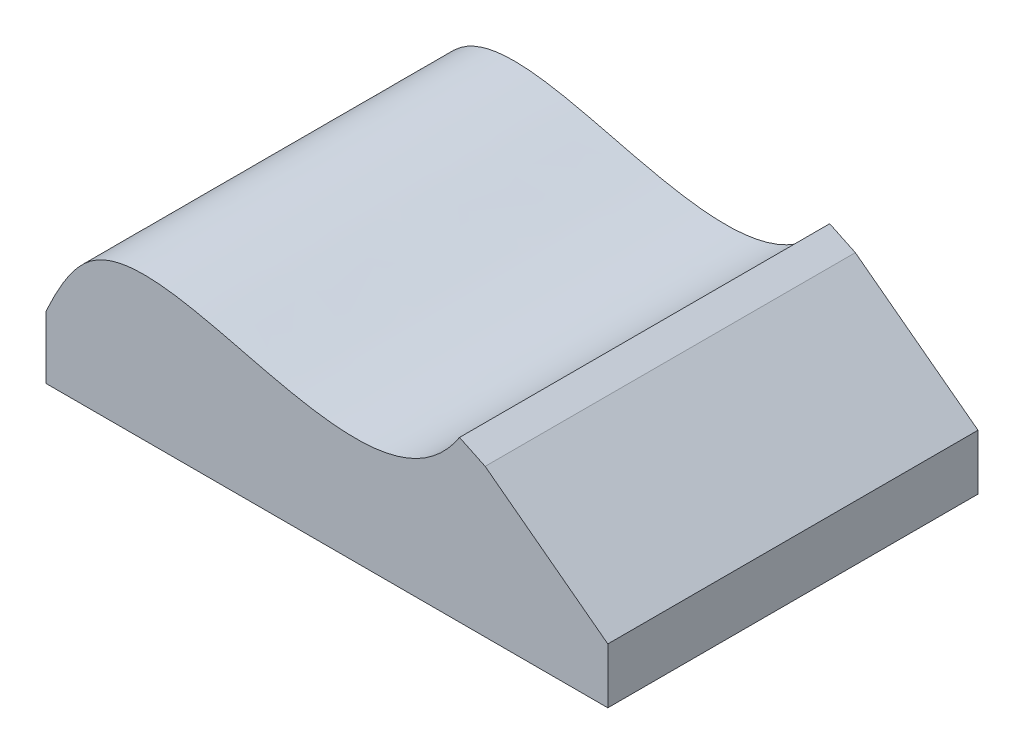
ISO-10303-21;
HEADER;
FILE_DESCRIPTION(('STEP AP214'),'2;1');
FILE_NAME('part.step','',(''),(''),'','','');
FILE_SCHEMA(('AUTOMOTIVE_DESIGN { 1 0 10303 214 1 1 1 1 }'));
ENDSEC;
DATA;
#1=APPLICATION_CONTEXT('core data for automotive mechanical design processes');
#2=APPLICATION_PROTOCOL_DEFINITION('international standard','automotive_design',2000,#1);
#3=PRODUCT_CONTEXT('',#1,'mechanical');
#4=PRODUCT('Part','Part','',(#3));
#5=PRODUCT_RELATED_PRODUCT_CATEGORY('part','',(#4));
#6=PRODUCT_DEFINITION_FORMATION('','',#4);
#7=PRODUCT_DEFINITION_CONTEXT('part definition',#1,'design');
#8=PRODUCT_DEFINITION('design','',#6,#7);
#9=PRODUCT_DEFINITION_SHAPE('','',#8);
#10=(LENGTH_UNIT() NAMED_UNIT(*) SI_UNIT(.MILLI.,.METRE.));
#11=(NAMED_UNIT(*) PLANE_ANGLE_UNIT() SI_UNIT($,.RADIAN.));
#12=(NAMED_UNIT(*) SI_UNIT($,.STERADIAN.) SOLID_ANGLE_UNIT());
#13=UNCERTAINTY_MEASURE_WITH_UNIT(LENGTH_MEASURE(1.E-05),#10,'distance_accuracy_value','');
#14=(GEOMETRIC_REPRESENTATION_CONTEXT(3) GLOBAL_UNCERTAINTY_ASSIGNED_CONTEXT((#13)) GLOBAL_UNIT_ASSIGNED_CONTEXT((#10,
#11,#12)) REPRESENTATION_CONTEXT('',''));
#15=CARTESIAN_POINT('',(0.,0.,0.));
#16=DIRECTION('',(0.,0.,1.));
#17=DIRECTION('',(1.,0.,0.));
#18=AXIS2_PLACEMENT_3D('',#15,#16,#17);
#19=CARTESIAN_POINT('',(0.,0.,0.));
#20=DIRECTION('',(0.,-1.,0.));
#21=DIRECTION('',(0.,0.,-1.));
#22=AXIS2_PLACEMENT_3D('',#19,#20,#21);
#23=PLANE('',#22);
#24=DIRECTION('',(0.,0.,-1.));
#25=VECTOR('',#24,1.);
#26=CARTESIAN_POINT('',(63.7046783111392,0.,41.9735477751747));
#27=LINE('',#26,#25);
#28=CARTESIAN_POINT('',(63.7046783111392,0.,41.9735477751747));
#29=VERTEX_POINT('',#28);
#30=CARTESIAN_POINT('',(63.7046783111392,0.,-41.9735477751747));
#31=VERTEX_POINT('',#30);
#32=EDGE_CURVE('E121',#29,#31,#27,.T.);
#33=ORIENTED_EDGE('',*,*,#32,.F.);
#34=DIRECTION('',(1.,0.,0.));
#35=VECTOR('',#34,1.);
#36=CARTESIAN_POINT('',(-63.7046783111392,0.,41.9735477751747));
#37=LINE('',#36,#35);
#38=CARTESIAN_POINT('',(-63.7046783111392,0.,41.9735477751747));
#39=VERTEX_POINT('',#38);
#40=EDGE_CURVE('E130',#39,#29,#37,.T.);
#41=ORIENTED_EDGE('',*,*,#40,.F.);
#42=DIRECTION('',(0.,0.,1.));
#43=VECTOR('',#42,1.);
#44=CARTESIAN_POINT('',(-63.7046783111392,0.,41.9735477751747));
#45=LINE('',#44,#43);
#46=CARTESIAN_POINT('',(-63.7046783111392,0.,-41.9735477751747));
#47=VERTEX_POINT('',#46);
#48=EDGE_CURVE('E127',#47,#39,#45,.T.);
#49=ORIENTED_EDGE('',*,*,#48,.F.);
#50=DIRECTION('',(-1.,0.,0.));
#51=VECTOR('',#50,1.);
#52=CARTESIAN_POINT('',(-63.7046783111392,0.,-41.9735477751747));
#53=LINE('',#52,#51);
#54=EDGE_CURVE('E124',#31,#47,#53,.T.);
#55=ORIENTED_EDGE('',*,*,#54,.F.);
#56=EDGE_LOOP('',(#33,#41,#49,#55));
#57=FACE_BOUND('',#56,.T.);
#58=ADVANCED_FACE('F51',(#57),#23,.T.);
#59=CARTESIAN_POINT('',(-63.7046783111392,81.0942234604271,41.9735477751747));
#60=DIRECTION('',(0.,0.,-1.));
#61=DIRECTION('',(-1.,0.,0.));
#62=AXIS2_PLACEMENT_3D('',#59,#60,#61);
#63=PLANE('',#62);
#64=DIRECTION('',(0.,-1.,0.));
#65=VECTOR('',#64,1.);
#66=CARTESIAN_POINT('',(63.7046783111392,81.0942234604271,41.9735477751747));
#67=LINE('',#66,#65);
#68=CARTESIAN_POINT('',(63.7046783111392,12.5515944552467,41.9735477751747));
#69=VERTEX_POINT('',#68);
#70=EDGE_CURVE('E107',#69,#29,#67,.T.);
#71=ORIENTED_EDGE('',*,*,#70,.F.);
#72=DIRECTION('',(-0.79864048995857,0.601808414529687,0.));
#73=VECTOR('',#72,1.);
#74=CARTESIAN_POINT('',(-50.5039480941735,98.6124857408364,41.9735477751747));
#75=LINE('',#74,#73);
#76=CARTESIAN_POINT('',(35.8817113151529,33.5173429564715,41.9735477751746));
#77=VERTEX_POINT('',#76);
#78=EDGE_CURVE('E55',#69,#77,#75,.T.);
#79=ORIENTED_EDGE('',*,*,#78,.T.);
#80=DIRECTION('',(-0.902315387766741,0.431076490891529,0.));
#81=VECTOR('',#80,1.);
#82=CARTESIAN_POINT('',(-63.7046783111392,81.0942234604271,41.9735477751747));
#83=LINE('',#82,#81);
#84=CARTESIAN_POINT('',(30.0707641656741,36.2934927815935,41.9735477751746));
#85=VERTEX_POINT('',#84);
#86=EDGE_CURVE('E92',#77,#85,#83,.T.);
#87=ORIENTED_EDGE('',*,*,#86,.T.);
#88=CARTESIAN_POINT('',(-93.1780801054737,-17.1143412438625,41.9735477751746));
#89=CARTESIAN_POINT('',(-67.9073890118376,-16.4926184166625,41.9735477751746));
#90=CARTESIAN_POINT('',(-66.3638296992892,72.5950068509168,41.9735477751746));
#91=CARTESIAN_POINT('',(17.2952972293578,1.40167204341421,41.9735477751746));
#92=CARTESIAN_POINT('',(33.7543758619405,43.5920418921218,41.9735477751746));
#93=B_SPLINE_CURVE_WITH_KNOTS('',3,(#88,#89,#90,#91,#92),.UNSPECIFIED.,.F.,.F.,(4,1,4),(0.,
0.404187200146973,1.),.UNSPECIFIED.);
#94=CARTESIAN_POINT('',(-63.7046783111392,14.1922229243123,41.9735477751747));
#95=VERTEX_POINT('',#94);
#96=EDGE_CURVE('E142',#85,#95,#93,.F.);
#97=ORIENTED_EDGE('',*,*,#96,.T.);
#98=DIRECTION('',(0.,-1.,0.));
#99=VECTOR('',#98,1.);
#100=CARTESIAN_POINT('',(-63.7046783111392,81.0942234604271,41.9735477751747));
#101=LINE('',#100,#99);
#102=EDGE_CURVE('E133',#95,#39,#101,.T.);
#103=ORIENTED_EDGE('',*,*,#102,.T.);
#104=ORIENTED_EDGE('',*,*,#40,.T.);
#105=EDGE_LOOP('',(#71,#79,#87,#97,#103,#104));
#106=FACE_BOUND('',#105,.T.);
#107=ADVANCED_FACE('F104',(#106),#63,.F.);
#108=CARTESIAN_POINT('',(-63.7046783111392,81.0942234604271,41.9735477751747));
#109=DIRECTION('',(1.,0.,0.));
#110=DIRECTION('',(0.,0.,-1.));
#111=AXIS2_PLACEMENT_3D('',#108,#109,#110);
#112=PLANE('',#111);
#113=ORIENTED_EDGE('',*,*,#102,.F.);
#114=DIRECTION('',(0.,0.,1.));
#115=VECTOR('',#114,1.);
#116=CARTESIAN_POINT('',(-63.7046783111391,14.192222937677,-76.2));
#117=LINE('',#116,#115);
#118=CARTESIAN_POINT('',(-63.7046783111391,14.192222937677,-41.9735477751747));
#119=VERTEX_POINT('',#118);
#120=EDGE_CURVE('E145',#95,#119,#117,.F.);
#121=ORIENTED_EDGE('',*,*,#120,.T.);
#122=DIRECTION('',(0.,-1.,0.));
#123=VECTOR('',#122,1.);
#124=CARTESIAN_POINT('',(-63.7046783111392,81.0942234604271,-41.9735477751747));
#125=LINE('',#124,#123);
#126=EDGE_CURVE('E136',#119,#47,#125,.T.);
#127=ORIENTED_EDGE('',*,*,#126,.T.);
#128=ORIENTED_EDGE('',*,*,#48,.T.);
#129=EDGE_LOOP('',(#113,#121,#127,#128));
#130=FACE_BOUND('',#129,.T.);
#131=ADVANCED_FACE('F171',(#130),#112,.F.);
#132=CARTESIAN_POINT('',(-63.7046783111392,81.0942234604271,-41.9735477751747));
#133=DIRECTION('',(0.,0.,1.));
#134=DIRECTION('',(1.,0.,0.));
#135=AXIS2_PLACEMENT_3D('',#132,#133,#134);
#136=PLANE('',#135);
#137=DIRECTION('',(0.902315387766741,-0.431076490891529,0.));
#138=VECTOR('',#137,1.);
#139=CARTESIAN_POINT('',(-63.7046783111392,81.0942234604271,-41.9735477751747));
#140=LINE('',#139,#138);
#141=CARTESIAN_POINT('',(30.0707641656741,36.2934927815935,-41.9735477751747));
#142=VERTEX_POINT('',#141);
#143=CARTESIAN_POINT('',(35.8817113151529,33.5173429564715,-41.9735477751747));
#144=VERTEX_POINT('',#143);
#145=EDGE_CURVE('E113',#142,#144,#140,.T.);
#146=ORIENTED_EDGE('',*,*,#145,.T.);
#147=DIRECTION('',(0.79864048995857,-0.601808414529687,0.));
#148=VECTOR('',#147,1.);
#149=CARTESIAN_POINT('',(-50.5039480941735,98.6124857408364,-41.9735477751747));
#150=LINE('',#149,#148);
#151=CARTESIAN_POINT('',(63.7046783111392,12.5515944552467,-41.9735477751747));
#152=VERTEX_POINT('',#151);
#153=EDGE_CURVE('E103',#144,#152,#150,.T.);
#154=ORIENTED_EDGE('',*,*,#153,.T.);
#155=DIRECTION('',(0.,-1.,0.));
#156=VECTOR('',#155,1.);
#157=CARTESIAN_POINT('',(63.7046783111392,81.0942234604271,-41.9735477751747));
#158=LINE('',#157,#156);
#159=EDGE_CURVE('E139',#152,#31,#158,.T.);
#160=ORIENTED_EDGE('',*,*,#159,.T.);
#161=ORIENTED_EDGE('',*,*,#54,.T.);
#162=ORIENTED_EDGE('',*,*,#126,.F.);
#163=CARTESIAN_POINT('',(-93.1780801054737,-17.1143412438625,-41.9735477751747));
#164=CARTESIAN_POINT('',(-67.9073890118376,-16.4926184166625,-41.9735477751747));
#165=CARTESIAN_POINT('',(-66.3638296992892,72.5950068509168,-41.9735477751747));
#166=CARTESIAN_POINT('',(17.2952972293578,1.40167204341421,-41.9735477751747));
#167=CARTESIAN_POINT('',(33.7543758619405,43.5920418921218,-41.9735477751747));
#168=B_SPLINE_CURVE_WITH_KNOTS('',3,(#163,#164,#165,#166,#167),.UNSPECIFIED.,.F.,.F.,(4,1,4),
(0.,0.404187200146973,1.),.UNSPECIFIED.);
#169=EDGE_CURVE('E70',#119,#142,#168,.T.);
#170=ORIENTED_EDGE('',*,*,#169,.T.);
#171=EDGE_LOOP('',(#146,#154,#160,#161,#162,#170));
#172=FACE_BOUND('',#171,.T.);
#173=ADVANCED_FACE('F173',(#172),#136,.F.);
#174=CARTESIAN_POINT('',(63.7046783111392,81.0942234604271,41.9735477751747));
#175=DIRECTION('',(-1.,0.,0.));
#176=DIRECTION('',(0.,0.,1.));
#177=AXIS2_PLACEMENT_3D('',#174,#175,#176);
#178=PLANE('',#177);
#179=ORIENTED_EDGE('',*,*,#159,.F.);
#180=DIRECTION('',(0.,0.,1.));
#181=VECTOR('',#180,1.);
#182=CARTESIAN_POINT('',(63.7046783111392,12.5515944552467,41.9735477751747));
#183=LINE('',#182,#181);
#184=EDGE_CURVE('E109',#152,#69,#183,.T.);
#185=ORIENTED_EDGE('',*,*,#184,.T.);
#186=ORIENTED_EDGE('',*,*,#70,.T.);
#187=ORIENTED_EDGE('',*,*,#32,.T.);
#188=EDGE_LOOP('',(#179,#185,#186,#187));
#189=FACE_BOUND('',#188,.T.);
#190=ADVANCED_FACE('F53',(#189),#178,.F.);
#191=CARTESIAN_POINT('',(-46.571238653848,72.9088116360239,-76.2));
#192=DIRECTION('',(-0.431076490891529,-0.902315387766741,0.));
#193=DIRECTION('',(0.902315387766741,-0.431076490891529,0.));
#194=AXIS2_PLACEMENT_3D('',#191,#192,#193);
#195=PLANE('',#194);
#196=DIRECTION('',(0.,0.,1.));
#197=VECTOR('',#196,1.);
#198=CARTESIAN_POINT('',(30.0707641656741,36.2934927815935,-76.2));
#199=LINE('',#198,#197);
#200=EDGE_CURVE('E61',#142,#85,#199,.T.);
#201=ORIENTED_EDGE('',*,*,#200,.T.);
#202=ORIENTED_EDGE('',*,*,#86,.F.);
#203=DIRECTION('',(0.,0.,1.));
#204=VECTOR('',#203,1.);
#205=CARTESIAN_POINT('',(35.8817113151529,33.5173429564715,-76.2));
#206=LINE('',#205,#204);
#207=EDGE_CURVE('E12',#144,#77,#206,.T.);
#208=ORIENTED_EDGE('',*,*,#207,.F.);
#209=ORIENTED_EDGE('',*,*,#145,.F.);
#210=EDGE_LOOP('',(#201,#202,#208,#209));
#211=FACE_BOUND('',#210,.T.);
#212=ADVANCED_FACE('F93',(#211),#195,.F.);
#213=CARTESIAN_POINT('',(35.8817113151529,33.5173429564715,-76.2));
#214=DIRECTION('',(-0.601808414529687,-0.79864048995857,0.));
#215=DIRECTION('',(0.79864048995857,-0.601808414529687,0.));
#216=AXIS2_PLACEMENT_3D('',#213,#214,#215);
#217=PLANE('',#216);
#218=ORIENTED_EDGE('',*,*,#207,.T.);
#219=ORIENTED_EDGE('',*,*,#78,.F.);
#220=ORIENTED_EDGE('',*,*,#184,.F.);
#221=ORIENTED_EDGE('',*,*,#153,.F.);
#222=EDGE_LOOP('',(#218,#219,#220,#221));
#223=FACE_BOUND('',#222,.T.);
#224=ADVANCED_FACE('F99',(#223),#217,.F.);
#225=CARTESIAN_POINT('',(-93.1780801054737,-17.1143412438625,-76.2));
#226=CARTESIAN_POINT('',(-67.9073890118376,-16.4926184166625,-76.2));
#227=CARTESIAN_POINT('',(-66.3638296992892,72.5950068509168,-76.2));
#228=CARTESIAN_POINT('',(17.2952972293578,1.40167204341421,-76.2));
#229=CARTESIAN_POINT('',(33.7543758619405,43.5920418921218,-76.2));
#230=B_SPLINE_CURVE_WITH_KNOTS('',3,(#225,#226,#227,#228,#229),.UNSPECIFIED.,.F.,.F.,(4,1,4),
(0.,0.404187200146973,1.),.UNSPECIFIED.);
#231=DIRECTION('',(0.,0.,1.));
#232=VECTOR('',#231,1.);
#233=SURFACE_OF_LINEAR_EXTRUSION('',#230,#232);
#234=ORIENTED_EDGE('',*,*,#120,.F.);
#235=ORIENTED_EDGE('',*,*,#96,.F.);
#236=ORIENTED_EDGE('',*,*,#200,.F.);
#237=ORIENTED_EDGE('',*,*,#169,.F.);
#238=EDGE_LOOP('',(#234,#235,#236,#237));
#239=FACE_BOUND('',#238,.T.);
#240=ADVANCED_FACE('F161',(#239),#233,.F.);
#241=CLOSED_SHELL('',(#58,#107,#131,#173,#190,#212,#224,#240));
#242=MANIFOLD_SOLID_BREP('B2',#241);
#243=ADVANCED_BREP_SHAPE_REPRESENTATION('',(#18,#242),#14);
#244=SHAPE_DEFINITION_REPRESENTATION(#9,#243);
ENDSEC;
END-ISO-10303-21;
